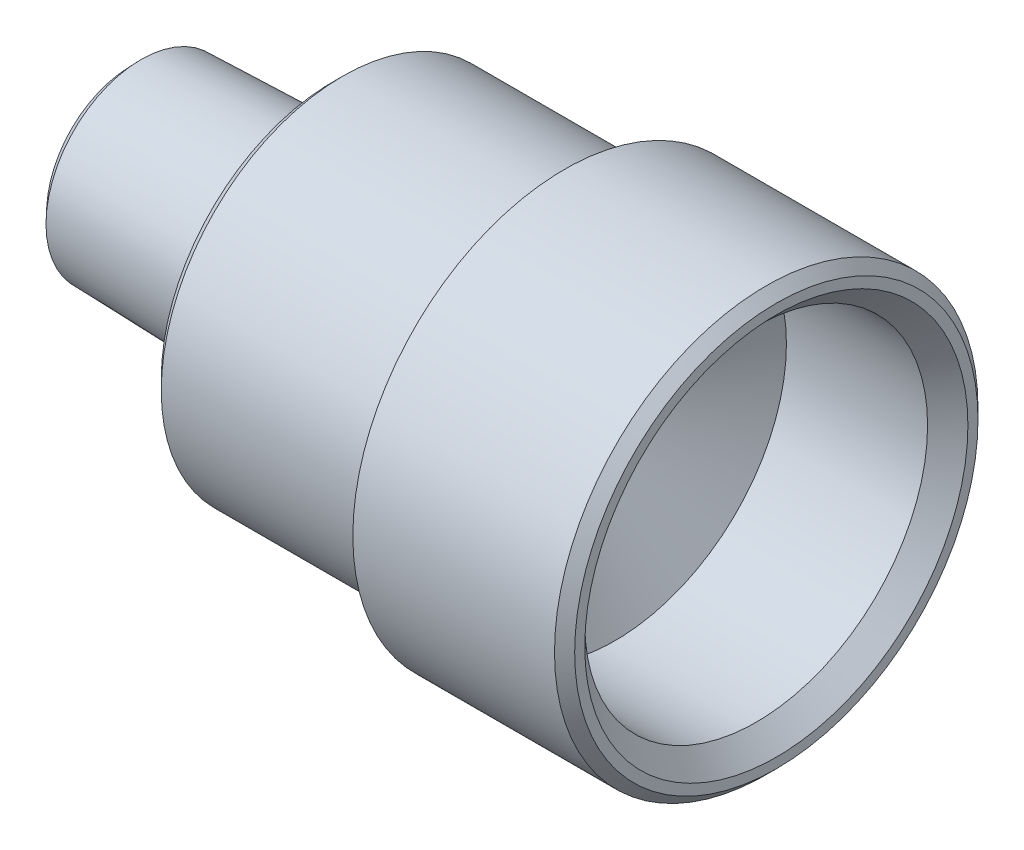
ISO-10303-21;
HEADER;
FILE_DESCRIPTION(('STEP AP214'),'2;1');
FILE_NAME('part.step','',(''),(''),'','','');
FILE_SCHEMA(('AUTOMOTIVE_DESIGN { 1 0 10303 214 1 1 1 1 }'));
ENDSEC;
DATA;
#1=APPLICATION_CONTEXT('core data for automotive mechanical design processes');
#2=APPLICATION_PROTOCOL_DEFINITION('international standard','automotive_design',2000,#1);
#3=PRODUCT_CONTEXT('',#1,'mechanical');
#4=PRODUCT('Part','Part','',(#3));
#5=PRODUCT_RELATED_PRODUCT_CATEGORY('part','',(#4));
#6=PRODUCT_DEFINITION_FORMATION('','',#4);
#7=PRODUCT_DEFINITION_CONTEXT('part definition',#1,'design');
#8=PRODUCT_DEFINITION('design','',#6,#7);
#9=PRODUCT_DEFINITION_SHAPE('','',#8);
#10=(LENGTH_UNIT() NAMED_UNIT(*) SI_UNIT(.MILLI.,.METRE.));
#11=(NAMED_UNIT(*) PLANE_ANGLE_UNIT() SI_UNIT($,.RADIAN.));
#12=(NAMED_UNIT(*) SI_UNIT($,.STERADIAN.) SOLID_ANGLE_UNIT());
#13=UNCERTAINTY_MEASURE_WITH_UNIT(LENGTH_MEASURE(1.E-05),#10,'distance_accuracy_value','');
#14=(GEOMETRIC_REPRESENTATION_CONTEXT(3) GLOBAL_UNCERTAINTY_ASSIGNED_CONTEXT((#13)) GLOBAL_UNIT_ASSIGNED_CONTEXT((#10,
#11,#12)) REPRESENTATION_CONTEXT('',''));
#15=CARTESIAN_POINT('',(0.,0.,0.));
#16=DIRECTION('',(0.,0.,1.));
#17=DIRECTION('',(1.,0.,0.));
#18=AXIS2_PLACEMENT_3D('',#15,#16,#17);
#19=CARTESIAN_POINT('',(0.,3.,0.));
#20=DIRECTION('',(1.,0.,0.));
#21=DIRECTION('',(0.,0.,-1.));
#22=AXIS2_PLACEMENT_3D('',#19,#20,#21);
#23=PLANE('',#22);
#24=CARTESIAN_POINT('',(0.,0.,0.));
#25=DIRECTION('',(1.,0.,0.));
#26=DIRECTION('',(0.,0.,-1.));
#27=AXIS2_PLACEMENT_3D('',#24,#25,#26);
#28=CIRCLE('',#27,4.18430417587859);
#29=CARTESIAN_POINT('',(0.,0.,-4.18430417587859));
#30=VERTEX_POINT('',#29);
#31=EDGE_CURVE('E208',#30,#30,#28,.F.);
#32=ORIENTED_EDGE('',*,*,#31,.T.);
#33=EDGE_LOOP('',(#32));
#34=FACE_BOUND('',#33,.T.);
#35=DIRECTION('',(0.,-0.866025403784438,-0.5));
#36=VECTOR('',#35,1.);
#37=CARTESIAN_POINT('',(0.,0.,3.46410161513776));
#38=LINE('',#37,#36);
#39=CARTESIAN_POINT('',(0.,0.,3.46410161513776));
#40=VERTEX_POINT('',#39);
#41=CARTESIAN_POINT('',(0.,-3.,1.73205080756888));
#42=VERTEX_POINT('',#41);
#43=EDGE_CURVE('E101',#40,#42,#38,.T.);
#44=ORIENTED_EDGE('',*,*,#43,.T.);
#45=DIRECTION('',(0.,0.,-1.));
#46=VECTOR('',#45,1.);
#47=CARTESIAN_POINT('',(0.,-3.,1.73205080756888));
#48=LINE('',#47,#46);
#49=CARTESIAN_POINT('',(0.,-3.,-1.73205080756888));
#50=VERTEX_POINT('',#49);
#51=EDGE_CURVE('E103',#42,#50,#48,.T.);
#52=ORIENTED_EDGE('',*,*,#51,.T.);
#53=DIRECTION('',(0.,0.866025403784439,-0.5));
#54=VECTOR('',#53,1.);
#55=CARTESIAN_POINT('',(0.,-3.,-1.73205080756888));
#56=LINE('',#55,#54);
#57=CARTESIAN_POINT('',(0.,0.,-3.46410161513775));
#58=VERTEX_POINT('',#57);
#59=EDGE_CURVE('E107',#50,#58,#56,.T.);
#60=ORIENTED_EDGE('',*,*,#59,.T.);
#61=DIRECTION('',(0.,0.866025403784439,0.5));
#62=VECTOR('',#61,1.);
#63=CARTESIAN_POINT('',(0.,0.,-3.46410161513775));
#64=LINE('',#63,#62);
#65=CARTESIAN_POINT('',(0.,3.,-1.73205080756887));
#66=VERTEX_POINT('',#65);
#67=EDGE_CURVE('E88',#58,#66,#64,.T.);
#68=ORIENTED_EDGE('',*,*,#67,.T.);
#69=DIRECTION('',(0.,0.,1.));
#70=VECTOR('',#69,1.);
#71=CARTESIAN_POINT('',(0.,3.,-1.73205080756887));
#72=LINE('',#71,#70);
#73=CARTESIAN_POINT('',(0.,3.,1.73205080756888));
#74=VERTEX_POINT('',#73);
#75=EDGE_CURVE('E84',#66,#74,#72,.T.);
#76=ORIENTED_EDGE('',*,*,#75,.T.);
#77=DIRECTION('',(0.,-0.866025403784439,0.5));
#78=VECTOR('',#77,1.);
#79=CARTESIAN_POINT('',(0.,3.,1.73205080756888));
#80=LINE('',#79,#78);
#81=EDGE_CURVE('E86',#74,#40,#80,.T.);
#82=ORIENTED_EDGE('',*,*,#81,.T.);
#83=EDGE_LOOP('',(#44,#52,#60,#68,#76,#82));
#84=FACE_BOUND('',#83,.T.);
#85=ADVANCED_FACE('F30',(#34,#84),#23,.F.);
#86=CARTESIAN_POINT('',(20.6269202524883,0.,0.));
#87=DIRECTION('',(1.,0.,0.));
#88=DIRECTION('',(0.,0.,-1.));
#89=AXIS2_PLACEMENT_3D('',#86,#87,#88);
#90=CONICAL_SURFACE('',#89,2.65765449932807,1.0471975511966);
#91=CARTESIAN_POINT('',(24.,0.,0.));
#92=DIRECTION('',(-1.,0.,0.));
#93=DIRECTION('',(0.,0.,1.));
#94=AXIS2_PLACEMENT_3D('',#91,#92,#93);
#95=CIRCLE('',#94,8.5);
#96=CARTESIAN_POINT('',(24.,0.,8.5));
#97=VERTEX_POINT('',#96);
#98=EDGE_CURVE('E243',#97,#97,#95,.T.);
#99=ORIENTED_EDGE('',*,*,#98,.F.);
#100=EDGE_LOOP('',(#99));
#101=FACE_BOUND('',#100,.T.);
#102=CARTESIAN_POINT('',(22.2722557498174,3.,-4.61866935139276));
#103=CARTESIAN_POINT('',(22.2089411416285,3.,-4.48786572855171));
#104=CARTESIAN_POINT('',(22.146243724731,3.,-4.35675805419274));
#105=CARTESIAN_POINT('',(22.0224312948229,3.,-4.09377266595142));
#106=CARTESIAN_POINT('',(21.9613165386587,3.,-3.96189483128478));
#107=CARTESIAN_POINT('',(21.8407029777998,3.,-3.6965119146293));
#108=CARTESIAN_POINT('',(21.7812150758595,3.,-3.56300185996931));
#109=CARTESIAN_POINT('',(21.6647211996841,3.,-3.29490727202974));
#110=CARTESIAN_POINT('',(21.6077151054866,3.,-3.16032279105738));
#111=CARTESIAN_POINT('',(21.4951612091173,3.,-2.88576608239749));
#112=CARTESIAN_POINT('',(21.4397098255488,3.,-2.74575410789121));
#113=CARTESIAN_POINT('',(21.3330863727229,3.,-2.46408000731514));
#114=CARTESIAN_POINT('',(21.2819147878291,3.,-2.32241769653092));
#115=CARTESIAN_POINT('',(21.1852182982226,3.,-2.03749334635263));
#116=CARTESIAN_POINT('',(21.1396816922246,3.,-1.89423531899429));
#117=CARTESIAN_POINT('',(21.0557380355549,3.,-1.60566556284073));
#118=CARTESIAN_POINT('',(21.0173287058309,3.,-1.46035450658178));
#119=CARTESIAN_POINT('',(20.9496927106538,3.,-1.16833868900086));
#120=CARTESIAN_POINT('',(20.9204209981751,3.,-1.0216445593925));
#121=CARTESIAN_POINT('',(20.8727588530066,3.,-0.72646932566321));
#122=CARTESIAN_POINT('',(20.8543673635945,3.,-0.577988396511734));
#123=CARTESIAN_POINT('',(20.830173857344,3.,-0.281905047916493));
#124=CARTESIAN_POINT('',(20.8242126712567,3.,-0.134315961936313));
#125=CARTESIAN_POINT('',(20.8249682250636,3.,0.160843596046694));
#126=CARTESIAN_POINT('',(20.8316855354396,3.,0.308414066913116));
#127=CARTESIAN_POINT('',(20.853464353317,3.,0.559874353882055));
#128=CARTESIAN_POINT('',(20.8655458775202,3.,0.664037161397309));
#129=CARTESIAN_POINT('',(20.895255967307,3.,0.871574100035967));
#130=CARTESIAN_POINT('',(20.912885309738,3.,0.974948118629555));
#131=CARTESIAN_POINT('',(20.9731654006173,3.,1.28375649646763));
#132=CARTESIAN_POINT('',(21.0231972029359,3.,1.4877646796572));
#133=CARTESIAN_POINT('',(21.1096611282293,3.,1.79294394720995));
#134=CARTESIAN_POINT('',(21.1408096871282,3.,1.89570136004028));
#135=CARTESIAN_POINT('',(21.2062608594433,3.,2.10021647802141));
#136=CARTESIAN_POINT('',(21.2405634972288,3.,2.20197417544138));
#137=CARTESIAN_POINT('',(21.3117788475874,3.,2.40452636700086));
#138=CARTESIAN_POINT('',(21.3486907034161,3.,2.5053211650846));
#139=CARTESIAN_POINT('',(21.4246981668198,3.,2.7060785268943));
#140=CARTESIAN_POINT('',(21.4637937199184,3.,2.80604111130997));
#141=CARTESIAN_POINT('',(21.5760730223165,3.,3.08558438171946));
#142=CARTESIAN_POINT('',(21.6513128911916,3.,3.26433855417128));
#143=CARTESIAN_POINT('',(21.8061066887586,3.,3.61997606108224));
#144=CARTESIAN_POINT('',(21.8856611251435,3.,3.79685917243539));
#145=CARTESIAN_POINT('',(22.0480061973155,3.,4.14920659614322));
#146=CARTESIAN_POINT('',(22.1307979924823,3.,4.3246703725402));
#147=CARTESIAN_POINT('',(22.2988141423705,3.,4.67443181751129));
#148=CARTESIAN_POINT('',(22.3840385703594,3.,4.84872945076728));
#149=CARTESIAN_POINT('',(22.5564988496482,3.,5.1966683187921));
#150=CARTESIAN_POINT('',(22.6437376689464,3.,5.37030807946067));
#151=CARTESIAN_POINT('',(22.8196954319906,3.,5.71683679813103));
#152=CARTESIAN_POINT('',(22.9084143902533,3.,5.88972574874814));
#153=CARTESIAN_POINT('',(23.1762812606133,3.,6.40740546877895));
#154=CARTESIAN_POINT('',(23.3571796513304,3.,6.75129000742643));
#155=CARTESIAN_POINT('',(23.7017478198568,3.,7.39924381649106));
#156=CARTESIAN_POINT('',(23.8650948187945,3.,7.70348553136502));
#157=CARTESIAN_POINT('',(24.1935655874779,3.,8.31103345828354));
#158=CARTESIAN_POINT('',(24.3586894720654,3.,8.61433960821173));
#159=CARTESIAN_POINT('',(24.6897006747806,3.,9.21924600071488));
#160=CARTESIAN_POINT('',(24.8555837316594,3.,9.52084857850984));
#161=CARTESIAN_POINT('',(25.1883453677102,3.,10.1234728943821));
#162=CARTESIAN_POINT('',(25.3552238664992,3.,10.4244946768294));
#163=CARTESIAN_POINT('',(25.5224626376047,3.,10.725315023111));
#164=B_SPLINE_CURVE_WITH_KNOTS('',3,(#102,#103,#104,#105,#106,#107,#108,#109,#110,#111,#112,
#113,#114,#115,#116,#117,#118,#119,#120,#121,#122,#123,#124,#125,#126,#127,#128,#129,#130,#131,
#132,#133,#134,#135,#136,#137,#138,#139,#140,#141,#142,#143,#144,#145,#146,#147,#148,#149,#150,
#151,#152,#153,#154,#155,#156,#157,#158,#159,#160,#161,#162,#163),.UNSPECIFIED.,.F.,.F.,(4,2,2,
2,2,2,2,2,2,2,2,2,2,2,2,2,2,2,2,2,2,2,2,2,2,2,2,2,2,2,4),(0.,0.435969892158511,
0.872010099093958,1.31048015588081,1.74892899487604,2.20065351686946,2.65242909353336,
3.10325020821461,3.55392691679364,4.00234542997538,4.45072038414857,4.89331775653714,
5.33593504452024,5.65036546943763,5.9648399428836,6.59412646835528,6.91622412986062,
7.23832428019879,7.56031915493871,7.8823060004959,8.4640486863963,9.04585997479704,
9.62788156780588,10.2099207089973,10.7928803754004,11.3758457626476,12.5415051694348,
13.5774565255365,14.6134752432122,15.6461066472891,16.6786557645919),.UNSPECIFIED.);
#165=CARTESIAN_POINT('',(21.0925227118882,3.,-1.73205080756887));
#166=VERTEX_POINT('',#165);
#167=CARTESIAN_POINT('',(21.0925227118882,3.,1.73205080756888));
#168=VERTEX_POINT('',#167);
#169=EDGE_CURVE('E52',#166,#168,#164,.T.);
#170=ORIENTED_EDGE('',*,*,#169,.F.);
#171=CARTESIAN_POINT('',(21.0925893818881,-0.000199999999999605,-3.46421708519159));
#172=CARTESIAN_POINT('',(21.0486272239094,0.131635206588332,-3.38810199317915));
#173=CARTESIAN_POINT('',(21.0086451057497,0.26460840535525,-3.31132988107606));
#174=CARTESIAN_POINT('',(20.9388555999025,0.532857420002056,-3.15645624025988));
#175=CARTESIAN_POINT('',(20.9090729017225,0.668138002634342,-3.078351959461));
#176=CARTESIAN_POINT('',(20.8627113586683,0.937022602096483,-2.92311136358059));
#177=CARTESIAN_POINT('',(20.84582396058,1.07058524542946,-2.84599893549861));
#178=CARTESIAN_POINT('',(20.8256631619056,1.33833905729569,-2.6914112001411));
#179=CARTESIAN_POINT('',(20.8223730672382,1.47252925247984,-2.61393645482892));
#180=CARTESIAN_POINT('',(20.8292140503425,1.72327559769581,-2.46916798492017));
#181=CARTESIAN_POINT('',(20.8376654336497,1.83986926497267,-2.40185259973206));
#182=CARTESIAN_POINT('',(20.8644524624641,2.07229698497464,-2.2676603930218));
#183=CARTESIAN_POINT('',(20.8827972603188,2.18813023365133,-2.2007840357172));
#184=CARTESIAN_POINT('',(20.9286582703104,2.42103725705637,-2.06631510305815));
#185=CARTESIAN_POINT('',(20.9563689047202,2.53808155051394,-1.99873954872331));
#186=CARTESIAN_POINT('',(21.0192613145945,2.77042435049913,-1.86459637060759));
#187=CARTESIAN_POINT('',(21.0544283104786,2.88572583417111,-1.79802702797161));
#188=CARTESIAN_POINT('',(21.0925893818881,3.0002,-1.73193533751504));
#189=B_SPLINE_CURVE_WITH_KNOTS('',3,(#171,#172,#173,#174,#175,#176,#177,#178,#179,#180,#181,
#182,#183,#184,#185,#186,#187,#188),.UNSPECIFIED.,.F.,.F.,(4,2,2,2,2,2,2,2,4),(0.,
0.475539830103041,0.952222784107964,1.41710776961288,1.88142182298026,2.28572436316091,
2.69040156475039,3.10405572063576,3.51689749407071),.UNSPECIFIED.);
#190=CARTESIAN_POINT('',(21.0925227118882,0.,-3.46410161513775));
#191=VERTEX_POINT('',#190);
#192=EDGE_CURVE('E95',#191,#166,#189,.T.);
#193=ORIENTED_EDGE('',*,*,#192,.F.);
#194=CARTESIAN_POINT('',(21.0925893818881,-3.0002,-1.73193533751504));
#195=CARTESIAN_POINT('',(21.0486272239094,-2.86836479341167,-1.80805042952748));
#196=CARTESIAN_POINT('',(21.0086451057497,-2.73539159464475,-1.88482254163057));
#197=CARTESIAN_POINT('',(20.9388555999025,-2.46714257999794,-2.03969618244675));
#198=CARTESIAN_POINT('',(20.9090729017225,-2.33186199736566,-2.11780046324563));
#199=CARTESIAN_POINT('',(20.8627113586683,-2.06297739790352,-2.27304105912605));
#200=CARTESIAN_POINT('',(20.84582396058,-1.92941475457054,-2.35015348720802));
#201=CARTESIAN_POINT('',(20.8256631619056,-1.66166094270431,-2.50474122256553));
#202=CARTESIAN_POINT('',(20.8223730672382,-1.52747074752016,-2.58221596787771));
#203=CARTESIAN_POINT('',(20.8292140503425,-1.27672440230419,-2.72698443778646));
#204=CARTESIAN_POINT('',(20.8376654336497,-1.16013073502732,-2.79429982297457));
#205=CARTESIAN_POINT('',(20.8644524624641,-0.927703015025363,-2.92849202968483));
#206=CARTESIAN_POINT('',(20.8827972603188,-0.811869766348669,-2.99536838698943));
#207=CARTESIAN_POINT('',(20.9286582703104,-0.578962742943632,-3.12983731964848));
#208=CARTESIAN_POINT('',(20.9563689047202,-0.461918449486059,-3.19741287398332));
#209=CARTESIAN_POINT('',(21.0192613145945,-0.229575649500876,-3.33155605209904));
#210=CARTESIAN_POINT('',(21.0544283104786,-0.114274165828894,-3.39812539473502));
#211=CARTESIAN_POINT('',(21.0925893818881,0.000199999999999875,-3.46421708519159));
#212=B_SPLINE_CURVE_WITH_KNOTS('',3,(#194,#195,#196,#197,#198,#199,#200,#201,#202,#203,#204,
#205,#206,#207,#208,#209,#210,#211),.UNSPECIFIED.,.F.,.F.,(4,2,2,2,2,2,2,2,4),(0.,
0.47553983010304,0.952222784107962,1.41710776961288,1.88142182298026,2.28572436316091,
2.69040156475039,3.10405572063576,3.5168974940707),.UNSPECIFIED.);
#213=CARTESIAN_POINT('',(21.0925227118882,-3.,-1.73205080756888));
#214=VERTEX_POINT('',#213);
#215=EDGE_CURVE('E126',#214,#191,#212,.T.);
#216=ORIENTED_EDGE('',*,*,#215,.F.);
#217=CARTESIAN_POINT('',(22.2722557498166,-3.,-4.61866935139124));
#218=CARTESIAN_POINT('',(22.2089411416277,-3.,-4.48786572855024));
#219=CARTESIAN_POINT('',(22.1462437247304,-3.,-4.35675805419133));
#220=CARTESIAN_POINT('',(22.0224312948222,-3.,-4.09377266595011));
#221=CARTESIAN_POINT('',(21.9613165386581,-3.,-3.96189483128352));
#222=CARTESIAN_POINT('',(21.8407029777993,-3.,-3.69651191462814));
#223=CARTESIAN_POINT('',(21.781215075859,-3.,-3.5630018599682));
#224=CARTESIAN_POINT('',(21.6647211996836,-3.,-3.29490727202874));
#225=CARTESIAN_POINT('',(21.6077151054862,-3.,-3.16032279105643));
#226=CARTESIAN_POINT('',(21.495161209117,-3.,-2.88576608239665));
#227=CARTESIAN_POINT('',(21.4397098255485,-3.,-2.74575410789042));
#228=CARTESIAN_POINT('',(21.3330863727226,-3.,-2.46408000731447));
#229=CARTESIAN_POINT('',(21.2819147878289,-3.,-2.32241769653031));
#230=CARTESIAN_POINT('',(21.1852182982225,-3.,-2.03749334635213));
#231=CARTESIAN_POINT('',(21.1396816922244,-3.,-1.89423531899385));
#232=CARTESIAN_POINT('',(21.0557380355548,-3.,-1.60566556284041));
#233=CARTESIAN_POINT('',(21.0173287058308,-3.,-1.46035450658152));
#234=CARTESIAN_POINT('',(20.9496927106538,-3.,-1.16833868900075));
#235=CARTESIAN_POINT('',(20.9204209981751,-3.,-1.02164455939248));
#236=CARTESIAN_POINT('',(20.8727588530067,-3.,-0.726469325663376));
#237=CARTESIAN_POINT('',(20.8543673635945,-3.,-0.577988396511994));
#238=CARTESIAN_POINT('',(20.830173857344,-3.,-0.28190504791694));
#239=CARTESIAN_POINT('',(20.8242126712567,-3.,-0.134315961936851));
#240=CARTESIAN_POINT('',(20.8249682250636,-3.,0.160843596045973));
#241=CARTESIAN_POINT('',(20.8316855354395,-3.,0.308414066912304));
#242=CARTESIAN_POINT('',(20.8534643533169,-3.,0.559874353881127));
#243=CARTESIAN_POINT('',(20.86554587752,-3.,0.664037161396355));
#244=CARTESIAN_POINT('',(20.8952559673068,-3.,0.871574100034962));
#245=CARTESIAN_POINT('',(20.9128853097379,-3.,0.974948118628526));
#246=CARTESIAN_POINT('',(20.9731654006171,-3.,1.28375649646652));
#247=CARTESIAN_POINT('',(21.0231972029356,-3.,1.48776467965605));
#248=CARTESIAN_POINT('',(21.109661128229,-3.,1.79294394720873));
#249=CARTESIAN_POINT('',(21.1408096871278,-3.,1.89570136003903));
#250=CARTESIAN_POINT('',(21.2062608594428,-3.,2.10021647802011));
#251=CARTESIAN_POINT('',(21.2405634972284,-3.,2.20197417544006));
#252=CARTESIAN_POINT('',(21.3117788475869,-3.,2.4045263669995));
#253=CARTESIAN_POINT('',(21.3486907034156,-3.,2.50532116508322));
#254=CARTESIAN_POINT('',(21.4246981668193,-3.,2.70607852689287));
#255=CARTESIAN_POINT('',(21.4637937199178,-3.,2.80604111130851));
#256=CARTESIAN_POINT('',(21.5760730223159,-3.,3.08558438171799));
#257=CARTESIAN_POINT('',(21.6513128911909,-3.,3.26433855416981));
#258=CARTESIAN_POINT('',(21.806106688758,-3.,3.6199760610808));
#259=CARTESIAN_POINT('',(21.8856611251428,-3.,3.79685917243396));
#260=CARTESIAN_POINT('',(22.0480061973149,-3.,4.1492065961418));
#261=CARTESIAN_POINT('',(22.1307979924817,-3.,4.3246703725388));
#262=CARTESIAN_POINT('',(22.2988141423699,-3.,4.6744318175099));
#263=CARTESIAN_POINT('',(22.3840385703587,-3.,4.84872945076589));
#264=CARTESIAN_POINT('',(22.5564988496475,-3.,5.19666831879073));
#265=CARTESIAN_POINT('',(22.6437376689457,-3.,5.37030807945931));
#266=CARTESIAN_POINT('',(22.8196954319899,-3.,5.71683679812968));
#267=CARTESIAN_POINT('',(22.9084143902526,-3.,5.88972574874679));
#268=CARTESIAN_POINT('',(23.1762812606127,-3.,6.40740546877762));
#269=CARTESIAN_POINT('',(23.3571796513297,-3.,6.75129000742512));
#270=CARTESIAN_POINT('',(23.7017478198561,-3.,7.39924381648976));
#271=CARTESIAN_POINT('',(23.8650948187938,-3.,7.70348553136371));
#272=CARTESIAN_POINT('',(24.1935655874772,-3.,8.31103345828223));
#273=CARTESIAN_POINT('',(24.3586894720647,-3.,8.61433960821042));
#274=CARTESIAN_POINT('',(24.6897006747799,-3.,9.21924600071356));
#275=CARTESIAN_POINT('',(24.8555837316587,-3.,9.52084857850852));
#276=CARTESIAN_POINT('',(25.1883453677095,-3.,10.1234728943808));
#277=CARTESIAN_POINT('',(25.3552238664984,-3.,10.424494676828));
#278=CARTESIAN_POINT('',(25.522462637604,-3.,10.7253150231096));
#279=B_SPLINE_CURVE_WITH_KNOTS('',3,(#217,#218,#219,#220,#221,#222,#223,#224,#225,#226,#227,
#228,#229,#230,#231,#232,#233,#234,#235,#236,#237,#238,#239,#240,#241,#242,#243,#244,#245,#246,
#247,#248,#249,#250,#251,#252,#253,#254,#255,#256,#257,#258,#259,#260,#261,#262,#263,#264,#265,
#266,#267,#268,#269,#270,#271,#272,#273,#274,#275,#276,#277,#278),.UNSPECIFIED.,.F.,.F.,(4,2,2,
2,2,2,2,2,2,2,2,2,2,2,2,2,2,2,2,2,2,2,2,2,2,2,2,2,2,2,4),(0.,0.435969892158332,
0.872010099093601,1.31048015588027,1.74892899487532,2.20065351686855,2.65242909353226,
3.10325020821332,3.55392691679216,4.00234542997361,4.45072038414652,4.89331775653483,
5.33593504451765,5.65036546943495,5.96483994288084,6.59412646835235,6.9162241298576,
7.23832428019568,7.56031915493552,7.88230600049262,8.46404868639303,9.04585997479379,
9.62788156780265,10.2099207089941,10.7928803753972,11.3758457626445,12.5415051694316,
13.5774565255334,14.613475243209,15.6461066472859,16.6786557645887),.UNSPECIFIED.);
#280=CARTESIAN_POINT('',(21.0925227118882,-3.,1.73205080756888));
#281=VERTEX_POINT('',#280);
#282=EDGE_CURVE('E152',#281,#214,#279,.F.);
#283=ORIENTED_EDGE('',*,*,#282,.F.);
#284=CARTESIAN_POINT('',(21.0925893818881,0.000199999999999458,3.46421708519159));
#285=CARTESIAN_POINT('',(21.0486272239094,-0.131635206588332,3.38810199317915));
#286=CARTESIAN_POINT('',(21.0086451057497,-0.264608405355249,3.31132988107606));
#287=CARTESIAN_POINT('',(20.9388555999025,-0.532857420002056,3.15645624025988));
#288=CARTESIAN_POINT('',(20.9090729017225,-0.668138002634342,3.078351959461));
#289=CARTESIAN_POINT('',(20.8627113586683,-0.937022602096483,2.92311136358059));
#290=CARTESIAN_POINT('',(20.84582396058,-1.07058524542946,2.84599893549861));
#291=CARTESIAN_POINT('',(20.8256631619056,-1.33833905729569,2.6914112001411));
#292=CARTESIAN_POINT('',(20.8223730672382,-1.47252925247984,2.61393645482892));
#293=CARTESIAN_POINT('',(20.8292140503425,-1.72327559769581,2.46916798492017));
#294=CARTESIAN_POINT('',(20.8376654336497,-1.83986926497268,2.40185259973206));
#295=CARTESIAN_POINT('',(20.8644524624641,-2.07229698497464,2.2676603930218));
#296=CARTESIAN_POINT('',(20.8827972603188,-2.18813023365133,2.2007840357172));
#297=CARTESIAN_POINT('',(20.9286582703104,-2.42103725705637,2.06631510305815));
#298=CARTESIAN_POINT('',(20.9563689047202,-2.53808155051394,1.99873954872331));
#299=CARTESIAN_POINT('',(21.0192613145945,-2.77042435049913,1.86459637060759));
#300=CARTESIAN_POINT('',(21.0544283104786,-2.88572583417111,1.79802702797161));
#301=CARTESIAN_POINT('',(21.0925893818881,-3.0002,1.73193533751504));
#302=B_SPLINE_CURVE_WITH_KNOTS('',3,(#284,#285,#286,#287,#288,#289,#290,#291,#292,#293,#294,
#295,#296,#297,#298,#299,#300,#301),.UNSPECIFIED.,.F.,.F.,(4,2,2,2,2,2,2,2,4),(0.,
0.475539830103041,0.952222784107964,1.41710776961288,1.88142182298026,2.28572436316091,
2.69040156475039,3.10405572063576,3.5168974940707),.UNSPECIFIED.);
#303=CARTESIAN_POINT('',(21.0925227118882,0.,3.46410161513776));
#304=VERTEX_POINT('',#303);
#305=EDGE_CURVE('E157',#304,#281,#302,.T.);
#306=ORIENTED_EDGE('',*,*,#305,.F.);
#307=CARTESIAN_POINT('',(21.0925893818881,3.0002,1.73193533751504));
#308=CARTESIAN_POINT('',(21.0486272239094,2.86836479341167,1.80805042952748));
#309=CARTESIAN_POINT('',(21.0086451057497,2.73539159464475,1.88482254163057));
#310=CARTESIAN_POINT('',(20.9388555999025,2.46714257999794,2.03969618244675));
#311=CARTESIAN_POINT('',(20.9090729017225,2.33186199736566,2.11780046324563));
#312=CARTESIAN_POINT('',(20.8627113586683,2.06297739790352,2.27304105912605));
#313=CARTESIAN_POINT('',(20.84582396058,1.92941475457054,2.35015348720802));
#314=CARTESIAN_POINT('',(20.8256631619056,1.66166094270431,2.50474122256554));
#315=CARTESIAN_POINT('',(20.8223730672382,1.52747074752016,2.58221596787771));
#316=CARTESIAN_POINT('',(20.8292140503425,1.27672440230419,2.72698443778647));
#317=CARTESIAN_POINT('',(20.8376654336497,1.16013073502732,2.79429982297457));
#318=CARTESIAN_POINT('',(20.8644524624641,0.927703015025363,2.92849202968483));
#319=CARTESIAN_POINT('',(20.8827972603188,0.811869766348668,2.99536838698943));
#320=CARTESIAN_POINT('',(20.9286582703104,0.578962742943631,3.12983731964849));
#321=CARTESIAN_POINT('',(20.9563689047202,0.461918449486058,3.19741287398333));
#322=CARTESIAN_POINT('',(21.0192613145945,0.229575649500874,3.33155605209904));
#323=CARTESIAN_POINT('',(21.0544283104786,0.114274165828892,3.39812539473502));
#324=CARTESIAN_POINT('',(21.0925893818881,-0.000200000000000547,3.46421708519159));
#325=B_SPLINE_CURVE_WITH_KNOTS('',3,(#307,#308,#309,#310,#311,#312,#313,#314,#315,#316,#317,
#318,#319,#320,#321,#322,#323,#324),.UNSPECIFIED.,.F.,.F.,(4,2,2,2,2,2,2,2,4),(0.,
0.475539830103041,0.952222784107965,1.41710776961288,1.88142182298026,2.28572436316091,
2.69040156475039,3.10405572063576,3.5168974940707),.UNSPECIFIED.);
#326=EDGE_CURVE('E162',#168,#304,#325,.T.);
#327=ORIENTED_EDGE('',*,*,#326,.F.);
#328=EDGE_LOOP('',(#170,#193,#216,#283,#306,#327));
#329=FACE_BOUND('',#328,.T.);
#330=ADVANCED_FACE('F132',(#101,#329),#90,.F.);
#331=CARTESIAN_POINT('',(10.,0.,0.));
#332=DIRECTION('',(1.,0.,0.));
#333=DIRECTION('',(0.,0.,-1.));
#334=AXIS2_PLACEMENT_3D('',#331,#332,#333);
#335=CONICAL_SURFACE('',#334,5.,0.0299910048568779);
#336=CARTESIAN_POINT('',(0.499775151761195,0.,0.));
#337=DIRECTION('',(-1.,0.,0.));
#338=DIRECTION('',(0.,0.,1.));
#339=AXIS2_PLACEMENT_3D('',#336,#337,#338);
#340=CIRCLE('',#339,4.71499325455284);
#341=CARTESIAN_POINT('',(0.499775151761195,0.,4.71499325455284));
#342=VERTEX_POINT('',#341);
#343=EDGE_CURVE('E210',#342,#342,#340,.F.);
#344=ORIENTED_EDGE('',*,*,#343,.T.);
#345=EDGE_LOOP('',(#344));
#346=FACE_BOUND('',#345,.T.);
#347=CARTESIAN_POINT('',(10.,0.,0.));
#348=DIRECTION('',(-1.,0.,0.));
#349=DIRECTION('',(0.,0.,1.));
#350=AXIS2_PLACEMENT_3D('',#347,#348,#349);
#351=CIRCLE('',#350,5.);
#352=CARTESIAN_POINT('',(10.,0.,5.));
#353=VERTEX_POINT('',#352);
#354=EDGE_CURVE('E233',#353,#353,#351,.T.);
#355=ORIENTED_EDGE('',*,*,#354,.T.);
#356=EDGE_LOOP('',(#355));
#357=FACE_BOUND('',#356,.T.);
#358=ADVANCED_FACE('F204',(#346,#357),#335,.T.);
#359=CARTESIAN_POINT('',(10.,5.,0.));
#360=DIRECTION('',(1.,0.,0.));
#361=DIRECTION('',(0.,0.,-1.));
#362=AXIS2_PLACEMENT_3D('',#359,#360,#361);
#363=PLANE('',#362);
#364=CARTESIAN_POINT('',(10.,0.,0.));
#365=DIRECTION('',(1.,0.,0.));
#366=DIRECTION('',(0.,0.,-1.));
#367=AXIS2_PLACEMENT_3D('',#364,#365,#366);
#368=CIRCLE('',#367,8.5);
#369=CARTESIAN_POINT('',(10.,0.,-8.5));
#370=VERTEX_POINT('',#369);
#371=EDGE_CURVE('E216',#370,#370,#368,.F.);
#372=ORIENTED_EDGE('',*,*,#371,.T.);
#373=EDGE_LOOP('',(#372));
#374=FACE_BOUND('',#373,.T.);
#375=ORIENTED_EDGE('',*,*,#354,.F.);
#376=EDGE_LOOP('',(#375));
#377=FACE_BOUND('',#376,.T.);
#378=ADVANCED_FACE('F356',(#374,#377),#363,.F.);
#379=CARTESIAN_POINT('',(-9.13304913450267,0.,0.));
#380=DIRECTION('',(-1.,0.,0.));
#381=DIRECTION('',(0.,0.,1.));
#382=AXIS2_PLACEMENT_3D('',#379,#380,#381);
#383=CYLINDRICAL_SURFACE('',#382,9.);
#384=CARTESIAN_POINT('',(10.5,0.,0.));
#385=DIRECTION('',(1.,0.,0.));
#386=DIRECTION('',(0.,0.,-1.));
#387=AXIS2_PLACEMENT_3D('',#384,#385,#386);
#388=CIRCLE('',#387,9.);
#389=CARTESIAN_POINT('',(10.5,0.,-9.));
#390=VERTEX_POINT('',#389);
#391=EDGE_CURVE('E211',#390,#390,#388,.T.);
#392=ORIENTED_EDGE('',*,*,#391,.T.);
#393=EDGE_LOOP('',(#392));
#394=FACE_BOUND('',#393,.T.);
#395=CARTESIAN_POINT('',(20.6339745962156,0.,0.));
#396=DIRECTION('',(-1.,0.,0.));
#397=DIRECTION('',(0.,0.,1.));
#398=AXIS2_PLACEMENT_3D('',#395,#396,#397);
#399=CIRCLE('',#398,9.);
#400=CARTESIAN_POINT('',(20.6339745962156,0.,9.));
#401=VERTEX_POINT('',#400);
#402=EDGE_CURVE('E238',#401,#401,#399,.T.);
#403=ORIENTED_EDGE('',*,*,#402,.T.);
#404=EDGE_LOOP('',(#403));
#405=FACE_BOUND('',#404,.T.);
#406=ADVANCED_FACE('F347',(#394,#405),#383,.T.);
#407=CARTESIAN_POINT('',(21.5,0.,0.));
#408=DIRECTION('',(1.,0.,0.));
#409=DIRECTION('',(0.,0.,-1.));
#410=AXIS2_PLACEMENT_3D('',#407,#408,#409);
#411=CONICAL_SURFACE('',#410,10.5,1.0471975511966);
#412=ORIENTED_EDGE('',*,*,#402,.F.);
#413=EDGE_LOOP('',(#412));
#414=FACE_BOUND('',#413,.T.);
#415=CARTESIAN_POINT('',(21.5,0.,0.));
#416=DIRECTION('',(-1.,0.,0.));
#417=DIRECTION('',(0.,0.,1.));
#418=AXIS2_PLACEMENT_3D('',#415,#416,#417);
#419=CIRCLE('',#418,10.5);
#420=CARTESIAN_POINT('',(21.5,0.,10.5));
#421=VERTEX_POINT('',#420);
#422=EDGE_CURVE('E241',#421,#421,#419,.T.);
#423=ORIENTED_EDGE('',*,*,#422,.T.);
#424=EDGE_LOOP('',(#423));
#425=FACE_BOUND('',#424,.T.);
#426=ADVANCED_FACE('F338',(#414,#425),#411,.T.);
#427=CARTESIAN_POINT('',(-9.13304913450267,0.,0.));
#428=DIRECTION('',(-1.,0.,0.));
#429=DIRECTION('',(0.,0.,1.));
#430=AXIS2_PLACEMENT_3D('',#427,#428,#429);
#431=CYLINDRICAL_SURFACE('',#430,10.5);
#432=CARTESIAN_POINT('',(31.5,0.,0.));
#433=DIRECTION('',(-1.,0.,0.));
#434=DIRECTION('',(0.,0.,1.));
#435=AXIS2_PLACEMENT_3D('',#432,#433,#434);
#436=CIRCLE('',#435,10.5);
#437=CARTESIAN_POINT('',(31.5,0.,10.5));
#438=VERTEX_POINT('',#437);
#439=EDGE_CURVE('E229',#438,#438,#436,.T.);
#440=ORIENTED_EDGE('',*,*,#439,.T.);
#441=EDGE_LOOP('',(#440));
#442=FACE_BOUND('',#441,.T.);
#443=ORIENTED_EDGE('',*,*,#422,.F.);
#444=EDGE_LOOP('',(#443));
#445=FACE_BOUND('',#444,.T.);
#446=ADVANCED_FACE('F225',(#442,#445),#431,.T.);
#447=CARTESIAN_POINT('',(32.,10.5,0.));
#448=DIRECTION('',(-1.,0.,0.));
#449=DIRECTION('',(0.,0.,1.));
#450=AXIS2_PLACEMENT_3D('',#447,#448,#449);
#451=PLANE('',#450);
#452=CARTESIAN_POINT('',(32.,0.,0.));
#453=DIRECTION('',(-1.,0.,0.));
#454=DIRECTION('',(0.,0.,1.));
#455=AXIS2_PLACEMENT_3D('',#452,#453,#454);
#456=CIRCLE('',#455,9.5);
#457=CARTESIAN_POINT('',(32.,0.,9.5));
#458=VERTEX_POINT('',#457);
#459=EDGE_CURVE('E37',#458,#458,#456,.T.);
#460=ORIENTED_EDGE('',*,*,#459,.T.);
#461=EDGE_LOOP('',(#460));
#462=FACE_BOUND('',#461,.T.);
#463=CARTESIAN_POINT('',(32.,0.,0.));
#464=DIRECTION('',(-1.,0.,0.));
#465=DIRECTION('',(0.,0.,1.));
#466=AXIS2_PLACEMENT_3D('',#463,#464,#465);
#467=CIRCLE('',#466,10.);
#468=CARTESIAN_POINT('',(32.,0.,10.));
#469=VERTEX_POINT('',#468);
#470=EDGE_CURVE('E228',#469,#469,#467,.F.);
#471=ORIENTED_EDGE('',*,*,#470,.T.);
#472=EDGE_LOOP('',(#471));
#473=FACE_BOUND('',#472,.T.);
#474=ADVANCED_FACE('F195',(#462,#473),#451,.F.);
#475=CARTESIAN_POINT('',(-9.13304913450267,0.,0.));
#476=DIRECTION('',(-1.,0.,0.));
#477=DIRECTION('',(0.,0.,1.));
#478=AXIS2_PLACEMENT_3D('',#475,#476,#477);
#479=CYLINDRICAL_SURFACE('',#478,8.5);
#480=CARTESIAN_POINT('',(31.,0.,0.));
#481=DIRECTION('',(-1.,0.,0.));
#482=DIRECTION('',(0.,0.,1.));
#483=AXIS2_PLACEMENT_3D('',#480,#481,#482);
#484=CIRCLE('',#483,8.5);
#485=CARTESIAN_POINT('',(31.,0.,8.5));
#486=VERTEX_POINT('',#485);
#487=EDGE_CURVE('E11',#486,#486,#484,.F.);
#488=ORIENTED_EDGE('',*,*,#487,.T.);
#489=EDGE_LOOP('',(#488));
#490=FACE_BOUND('',#489,.T.);
#491=ORIENTED_EDGE('',*,*,#98,.T.);
#492=EDGE_LOOP('',(#491));
#493=FACE_BOUND('',#492,.T.);
#494=ADVANCED_FACE('F190',(#490,#493),#479,.F.);
#495=CARTESIAN_POINT('',(31.5,0.,0.));
#496=DIRECTION('',(-1.,0.,0.));
#497=DIRECTION('',(0.,0.,1.));
#498=AXIS2_PLACEMENT_3D('',#495,#496,#497);
#499=CONICAL_SURFACE('',#498,10.5,0.785398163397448);
#500=ORIENTED_EDGE('',*,*,#470,.F.);
#501=EDGE_LOOP('',(#500));
#502=FACE_BOUND('',#501,.T.);
#503=ORIENTED_EDGE('',*,*,#439,.F.);
#504=EDGE_LOOP('',(#503));
#505=FACE_BOUND('',#504,.T.);
#506=ADVANCED_FACE('F187',(#502,#505),#499,.T.);
#507=CARTESIAN_POINT('',(10.,0.,0.));
#508=DIRECTION('',(1.,0.,0.));
#509=DIRECTION('',(0.,0.,-1.));
#510=AXIS2_PLACEMENT_3D('',#507,#508,#509);
#511=CONICAL_SURFACE('',#510,8.5,0.785398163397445);
#512=ORIENTED_EDGE('',*,*,#391,.F.);
#513=EDGE_LOOP('',(#512));
#514=FACE_BOUND('',#513,.T.);
#515=ORIENTED_EDGE('',*,*,#371,.F.);
#516=EDGE_LOOP('',(#515));
#517=FACE_BOUND('',#516,.T.);
#518=ADVANCED_FACE('F184',(#514,#517),#511,.T.);
#519=CARTESIAN_POINT('',(0.,0.,0.));
#520=DIRECTION('',(1.,0.,0.));
#521=DIRECTION('',(0.,0.,-1.));
#522=AXIS2_PLACEMENT_3D('',#519,#520,#521);
#523=CONICAL_SURFACE('',#522,4.18430417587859,0.815389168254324);
#524=ORIENTED_EDGE('',*,*,#343,.F.);
#525=EDGE_LOOP('',(#524));
#526=FACE_BOUND('',#525,.T.);
#527=ORIENTED_EDGE('',*,*,#31,.F.);
#528=EDGE_LOOP('',(#527));
#529=FACE_BOUND('',#528,.T.);
#530=ADVANCED_FACE('F180',(#526,#529),#523,.T.);
#531=CARTESIAN_POINT('',(32.,0.,0.));
#532=DIRECTION('',(1.,0.,0.));
#533=DIRECTION('',(0.,0.,-1.));
#534=AXIS2_PLACEMENT_3D('',#531,#532,#533);
#535=CONICAL_SURFACE('',#534,9.5,0.785398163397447);
#536=ORIENTED_EDGE('',*,*,#487,.F.);
#537=EDGE_LOOP('',(#536));
#538=FACE_BOUND('',#537,.T.);
#539=ORIENTED_EDGE('',*,*,#459,.F.);
#540=EDGE_LOOP('',(#539));
#541=FACE_BOUND('',#540,.T.);
#542=ADVANCED_FACE('F177',(#538,#541),#535,.F.);
#543=CARTESIAN_POINT('',(32.,3.,-1.73205080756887));
#544=DIRECTION('',(0.,-1.,0.));
#545=DIRECTION('',(0.,0.,-1.));
#546=AXIS2_PLACEMENT_3D('',#543,#544,#545);
#547=PLANE('',#546);
#548=ORIENTED_EDGE('',*,*,#169,.T.);
#549=DIRECTION('',(-1.,0.,0.));
#550=VECTOR('',#549,1.);
#551=CARTESIAN_POINT('',(32.,3.,1.73205080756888));
#552=LINE('',#551,#550);
#553=EDGE_CURVE('E91',#168,#74,#552,.T.);
#554=ORIENTED_EDGE('',*,*,#553,.T.);
#555=ORIENTED_EDGE('',*,*,#75,.F.);
#556=DIRECTION('',(-1.,0.,0.));
#557=VECTOR('',#556,1.);
#558=CARTESIAN_POINT('',(32.,3.,-1.73205080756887));
#559=LINE('',#558,#557);
#560=EDGE_CURVE('E110',#166,#66,#559,.T.);
#561=ORIENTED_EDGE('',*,*,#560,.F.);
#562=EDGE_LOOP('',(#548,#554,#555,#561));
#563=FACE_BOUND('',#562,.T.);
#564=ADVANCED_FACE('F92',(#563),#547,.T.);
#565=CARTESIAN_POINT('',(32.,3.,1.73205080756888));
#566=DIRECTION('',(0.,-0.5,-0.866025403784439));
#567=DIRECTION('',(0.,0.866025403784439,-0.5));
#568=AXIS2_PLACEMENT_3D('',#565,#566,#567);
#569=PLANE('',#568);
#570=ORIENTED_EDGE('',*,*,#326,.T.);
#571=DIRECTION('',(-1.,0.,0.));
#572=VECTOR('',#571,1.);
#573=CARTESIAN_POINT('',(32.,0.,3.46410161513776));
#574=LINE('',#573,#572);
#575=EDGE_CURVE('E96',#304,#40,#574,.T.);
#576=ORIENTED_EDGE('',*,*,#575,.T.);
#577=ORIENTED_EDGE('',*,*,#81,.F.);
#578=ORIENTED_EDGE('',*,*,#553,.F.);
#579=EDGE_LOOP('',(#570,#576,#577,#578));
#580=FACE_BOUND('',#579,.T.);
#581=ADVANCED_FACE('F98',(#580),#569,.T.);
#582=CARTESIAN_POINT('',(32.,0.,3.46410161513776));
#583=DIRECTION('',(0.,0.5,-0.866025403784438));
#584=DIRECTION('',(0.,0.866025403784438,0.5));
#585=AXIS2_PLACEMENT_3D('',#582,#583,#584);
#586=PLANE('',#585);
#587=ORIENTED_EDGE('',*,*,#305,.T.);
#588=DIRECTION('',(-1.,0.,0.));
#589=VECTOR('',#588,1.);
#590=CARTESIAN_POINT('',(32.,-3.,1.73205080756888));
#591=LINE('',#590,#589);
#592=EDGE_CURVE('E116',#281,#42,#591,.T.);
#593=ORIENTED_EDGE('',*,*,#592,.T.);
#594=ORIENTED_EDGE('',*,*,#43,.F.);
#595=ORIENTED_EDGE('',*,*,#575,.F.);
#596=EDGE_LOOP('',(#587,#593,#594,#595));
#597=FACE_BOUND('',#596,.T.);
#598=ADVANCED_FACE('F148',(#597),#586,.T.);
#599=CARTESIAN_POINT('',(32.,-3.,1.73205080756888));
#600=DIRECTION('',(0.,1.,0.));
#601=DIRECTION('',(0.,0.,1.));
#602=AXIS2_PLACEMENT_3D('',#599,#600,#601);
#603=PLANE('',#602);
#604=ORIENTED_EDGE('',*,*,#282,.T.);
#605=DIRECTION('',(-1.,0.,0.));
#606=VECTOR('',#605,1.);
#607=CARTESIAN_POINT('',(32.,-3.,-1.73205080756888));
#608=LINE('',#607,#606);
#609=EDGE_CURVE('E113',#214,#50,#608,.T.);
#610=ORIENTED_EDGE('',*,*,#609,.T.);
#611=ORIENTED_EDGE('',*,*,#51,.F.);
#612=ORIENTED_EDGE('',*,*,#592,.F.);
#613=EDGE_LOOP('',(#604,#610,#611,#612));
#614=FACE_BOUND('',#613,.T.);
#615=ADVANCED_FACE('F143',(#614),#603,.T.);
#616=CARTESIAN_POINT('',(32.,-3.,-1.73205080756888));
#617=DIRECTION('',(0.,0.5,0.866025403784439));
#618=DIRECTION('',(0.,-0.866025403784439,0.5));
#619=AXIS2_PLACEMENT_3D('',#616,#617,#618);
#620=PLANE('',#619);
#621=ORIENTED_EDGE('',*,*,#215,.T.);
#622=DIRECTION('',(-1.,0.,0.));
#623=VECTOR('',#622,1.);
#624=CARTESIAN_POINT('',(32.,0.,-3.46410161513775));
#625=LINE('',#624,#623);
#626=EDGE_CURVE('E44',#191,#58,#625,.T.);
#627=ORIENTED_EDGE('',*,*,#626,.T.);
#628=ORIENTED_EDGE('',*,*,#59,.F.);
#629=ORIENTED_EDGE('',*,*,#609,.F.);
#630=EDGE_LOOP('',(#621,#627,#628,#629));
#631=FACE_BOUND('',#630,.T.);
#632=ADVANCED_FACE('F139',(#631),#620,.T.);
#633=CARTESIAN_POINT('',(32.,0.,-3.46410161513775));
#634=DIRECTION('',(0.,-0.5,0.866025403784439));
#635=DIRECTION('',(0.,-0.866025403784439,-0.5));
#636=AXIS2_PLACEMENT_3D('',#633,#634,#635);
#637=PLANE('',#636);
#638=ORIENTED_EDGE('',*,*,#192,.T.);
#639=ORIENTED_EDGE('',*,*,#560,.T.);
#640=ORIENTED_EDGE('',*,*,#67,.F.);
#641=ORIENTED_EDGE('',*,*,#626,.F.);
#642=EDGE_LOOP('',(#638,#639,#640,#641));
#643=FACE_BOUND('',#642,.T.);
#644=ADVANCED_FACE('F136',(#643),#637,.T.);
#645=CLOSED_SHELL('',(#85,#330,#358,#378,#406,#426,#446,#474,#494,#506,#518,#530,#542,#564,#581,
#598,#615,#632,#644));
#646=MANIFOLD_SOLID_BREP('B2',#645);
#647=ADVANCED_BREP_SHAPE_REPRESENTATION('',(#18,#646),#14);
#648=SHAPE_DEFINITION_REPRESENTATION(#9,#647);
ENDSEC;
END-ISO-10303-21;
